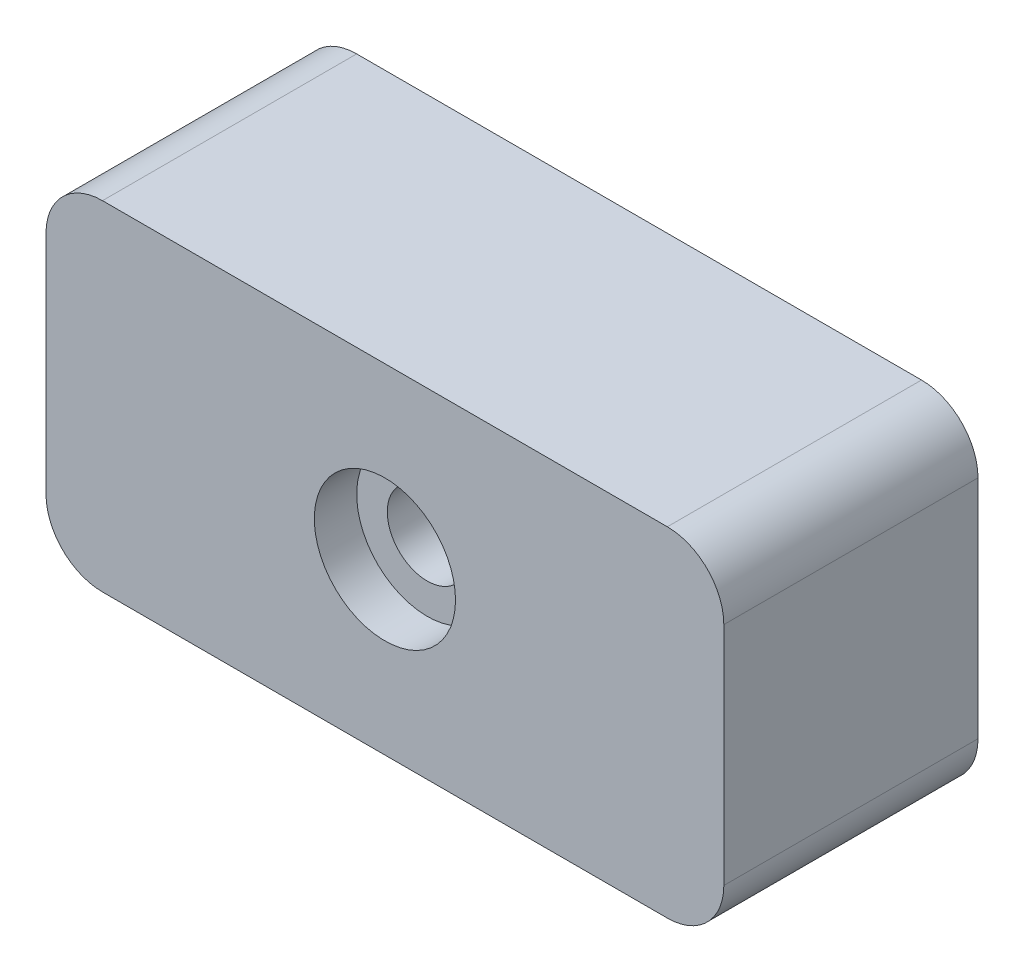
ISO-10303-21;
HEADER;
FILE_DESCRIPTION(('STEP AP214'),'2;1');
FILE_NAME('part.step','',(''),(''),'','','');
FILE_SCHEMA(('AUTOMOTIVE_DESIGN { 1 0 10303 214 1 1 1 1 }'));
ENDSEC;
DATA;
#1=APPLICATION_CONTEXT('core data for automotive mechanical design processes');
#2=APPLICATION_PROTOCOL_DEFINITION('international standard','automotive_design',2000,#1);
#3=PRODUCT_CONTEXT('',#1,'mechanical');
#4=PRODUCT('Part','Part','',(#3));
#5=PRODUCT_RELATED_PRODUCT_CATEGORY('part','',(#4));
#6=PRODUCT_DEFINITION_FORMATION('','',#4);
#7=PRODUCT_DEFINITION_CONTEXT('part definition',#1,'design');
#8=PRODUCT_DEFINITION('design','',#6,#7);
#9=PRODUCT_DEFINITION_SHAPE('','',#8);
#10=(LENGTH_UNIT() NAMED_UNIT(*) SI_UNIT(.MILLI.,.METRE.));
#11=(NAMED_UNIT(*) PLANE_ANGLE_UNIT() SI_UNIT($,.RADIAN.));
#12=(NAMED_UNIT(*) SI_UNIT($,.STERADIAN.) SOLID_ANGLE_UNIT());
#13=UNCERTAINTY_MEASURE_WITH_UNIT(LENGTH_MEASURE(1.E-05),#10,'distance_accuracy_value','');
#14=(GEOMETRIC_REPRESENTATION_CONTEXT(3) GLOBAL_UNCERTAINTY_ASSIGNED_CONTEXT((#13)) GLOBAL_UNIT_ASSIGNED_CONTEXT((#10,
#11,#12)) REPRESENTATION_CONTEXT('',''));
#15=CARTESIAN_POINT('',(0.,0.,0.));
#16=DIRECTION('',(0.,0.,1.));
#17=DIRECTION('',(1.,0.,0.));
#18=AXIS2_PLACEMENT_3D('',#15,#16,#17);
#19=CARTESIAN_POINT('',(19.05,-9.52500000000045,14.2875000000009));
#20=DIRECTION('',(-1.,0.,0.));
#21=DIRECTION('',(0.,0.,0.999999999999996));
#22=AXIS2_PLACEMENT_3D('',#19,#20,#21);
#23=PLANE('',#22);
#24=DIRECTION('',(0.,1.,0.));
#25=VECTOR('',#24,1.);
#26=CARTESIAN_POINT('',(19.05,-9.52500000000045,14.2875000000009));
#27=LINE('',#26,#25);
#28=CARTESIAN_POINT('',(19.0499999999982,-6.35000000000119,14.2875000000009));
#29=VERTEX_POINT('',#28);
#30=CARTESIAN_POINT('',(19.0499999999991,6.34999999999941,14.2875));
#31=VERTEX_POINT('',#30);
#32=EDGE_CURVE('E124',#29,#31,#27,.T.);
#33=ORIENTED_EDGE('',*,*,#32,.F.);
#34=DIRECTION('',(0.,0.,-0.999999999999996));
#35=VECTOR('',#34,1.);
#36=CARTESIAN_POINT('',(19.0499999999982,-6.35000000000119,14.2875000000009));
#37=LINE('',#36,#35);
#38=CARTESIAN_POINT('',(19.0499999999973,-6.3500000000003,-8.88178419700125E-13));
#39=VERTEX_POINT('',#38);
#40=EDGE_CURVE('E109',#29,#39,#37,.T.);
#41=ORIENTED_EDGE('',*,*,#40,.T.);
#42=DIRECTION('',(0.,1.,0.));
#43=VECTOR('',#42,1.);
#44=CARTESIAN_POINT('',(19.0499999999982,-9.52500000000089,0.));
#45=LINE('',#44,#43);
#46=CARTESIAN_POINT('',(19.05,6.34999999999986,0.));
#47=VERTEX_POINT('',#46);
#48=EDGE_CURVE('E121',#39,#47,#45,.T.);
#49=ORIENTED_EDGE('',*,*,#48,.T.);
#50=DIRECTION('',(0.,0.,-0.999999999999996));
#51=VECTOR('',#50,1.);
#52=CARTESIAN_POINT('',(19.0499999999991,6.34999999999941,14.2875));
#53=LINE('',#52,#51);
#54=EDGE_CURVE('E126',#47,#31,#53,.F.);
#55=ORIENTED_EDGE('',*,*,#54,.T.);
#56=EDGE_LOOP('',(#33,#41,#49,#55));
#57=FACE_BOUND('',#56,.T.);
#58=ADVANCED_FACE('F38',(#57),#23,.F.);
#59=CARTESIAN_POINT('',(-19.0500000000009,9.52499999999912,14.2875));
#60=DIRECTION('',(0.,-1.,0.));
#61=DIRECTION('',(0.,0.,-0.999999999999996));
#62=AXIS2_PLACEMENT_3D('',#59,#60,#61);
#63=PLANE('',#62);
#64=DIRECTION('',(-1.,0.,0.));
#65=VECTOR('',#64,1.);
#66=CARTESIAN_POINT('',(-19.0500000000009,9.52499999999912,14.2875));
#67=LINE('',#66,#65);
#68=CARTESIAN_POINT('',(15.8750000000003,9.52500000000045,14.2875000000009));
#69=VERTEX_POINT('',#68);
#70=CARTESIAN_POINT('',(-15.8750000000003,9.52500000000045,14.2874999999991));
#71=VERTEX_POINT('',#70);
#72=EDGE_CURVE('E168',#69,#71,#67,.T.);
#73=ORIENTED_EDGE('',*,*,#72,.F.);
#74=DIRECTION('',(0.,0.,-0.999999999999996));
#75=VECTOR('',#74,1.);
#76=CARTESIAN_POINT('',(15.8750000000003,9.52500000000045,14.2875000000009));
#77=LINE('',#76,#75);
#78=CARTESIAN_POINT('',(15.8750000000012,9.52500000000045,8.88178419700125E-13));
#79=VERTEX_POINT('',#78);
#80=EDGE_CURVE('E11',#69,#79,#77,.T.);
#81=ORIENTED_EDGE('',*,*,#80,.T.);
#82=DIRECTION('',(-1.,0.,0.));
#83=VECTOR('',#82,1.);
#84=CARTESIAN_POINT('',(-19.05,9.52499999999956,-8.88178419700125E-13));
#85=LINE('',#84,#83);
#86=CARTESIAN_POINT('',(-15.8750000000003,9.52500000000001,0.));
#87=VERTEX_POINT('',#86);
#88=EDGE_CURVE('E131',#79,#87,#85,.T.);
#89=ORIENTED_EDGE('',*,*,#88,.T.);
#90=DIRECTION('',(0.,0.,-0.999999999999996));
#91=VECTOR('',#90,1.);
#92=CARTESIAN_POINT('',(-15.8750000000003,9.52500000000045,14.2874999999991));
#93=LINE('',#92,#91);
#94=EDGE_CURVE('E46',#87,#71,#93,.F.);
#95=ORIENTED_EDGE('',*,*,#94,.T.);
#96=EDGE_LOOP('',(#73,#81,#89,#95));
#97=FACE_BOUND('',#96,.T.);
#98=ADVANCED_FACE('F167',(#97),#63,.F.);
#99=CARTESIAN_POINT('',(-19.0500000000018,-9.52500000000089,14.2874999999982));
#100=DIRECTION('',(1.,0.,0.));
#101=DIRECTION('',(0.,0.,-0.999999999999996));
#102=AXIS2_PLACEMENT_3D('',#99,#100,#101);
#103=PLANE('',#102);
#104=DIRECTION('',(0.,-1.,0.));
#105=VECTOR('',#104,1.);
#106=CARTESIAN_POINT('',(-19.0500000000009,-9.52500000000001,0.));
#107=LINE('',#106,#105);
#108=CARTESIAN_POINT('',(-19.05,6.34999999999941,0.));
#109=VERTEX_POINT('',#108);
#110=CARTESIAN_POINT('',(-19.0500000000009,-6.35000000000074,8.88178419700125E-13));
#111=VERTEX_POINT('',#110);
#112=EDGE_CURVE('E135',#109,#111,#107,.T.);
#113=ORIENTED_EDGE('',*,*,#112,.T.);
#114=DIRECTION('',(0.,0.,-0.999999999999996));
#115=VECTOR('',#114,1.);
#116=CARTESIAN_POINT('',(-19.05,-6.34999999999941,14.2875));
#117=LINE('',#116,#115);
#118=CARTESIAN_POINT('',(-19.05,-6.34999999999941,14.2875));
#119=VERTEX_POINT('',#118);
#120=EDGE_CURVE('E53',#111,#119,#117,.F.);
#121=ORIENTED_EDGE('',*,*,#120,.T.);
#122=DIRECTION('',(0.,-1.,0.));
#123=VECTOR('',#122,1.);
#124=CARTESIAN_POINT('',(-19.0500000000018,-9.52500000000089,14.2874999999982));
#125=LINE('',#124,#123);
#126=CARTESIAN_POINT('',(-19.0500000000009,6.34999999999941,14.2875));
#127=VERTEX_POINT('',#126);
#128=EDGE_CURVE('E174',#127,#119,#125,.T.);
#129=ORIENTED_EDGE('',*,*,#128,.F.);
#130=DIRECTION('',(0.,0.,-0.999999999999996));
#131=VECTOR('',#130,1.);
#132=CARTESIAN_POINT('',(-19.0500000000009,6.34999999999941,14.2875));
#133=LINE('',#132,#131);
#134=EDGE_CURVE('E161',#127,#109,#133,.T.);
#135=ORIENTED_EDGE('',*,*,#134,.T.);
#136=EDGE_LOOP('',(#113,#121,#129,#135));
#137=FACE_BOUND('',#136,.T.);
#138=ADVANCED_FACE('F178',(#137),#103,.F.);
#139=CARTESIAN_POINT('',(-19.0500000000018,-9.52500000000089,14.2874999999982));
#140=DIRECTION('',(0.,1.,0.));
#141=DIRECTION('',(0.,0.,0.999999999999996));
#142=AXIS2_PLACEMENT_3D('',#139,#140,#141);
#143=PLANE('',#142);
#144=DIRECTION('',(1.,0.,0.));
#145=VECTOR('',#144,1.);
#146=CARTESIAN_POINT('',(-19.0500000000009,-9.52500000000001,0.));
#147=LINE('',#146,#145);
#148=CARTESIAN_POINT('',(-15.8749999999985,-9.52500000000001,0.));
#149=VERTEX_POINT('',#148);
#150=CARTESIAN_POINT('',(15.8749999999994,-9.52500000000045,8.88178419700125E-13));
#151=VERTEX_POINT('',#150);
#152=EDGE_CURVE('E145',#149,#151,#147,.T.);
#153=ORIENTED_EDGE('',*,*,#152,.T.);
#154=DIRECTION('',(0.,0.,-0.999999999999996));
#155=VECTOR('',#154,1.);
#156=CARTESIAN_POINT('',(15.8749999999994,-9.52500000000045,14.2875));
#157=LINE('',#156,#155);
#158=CARTESIAN_POINT('',(15.8749999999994,-9.52500000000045,14.2875));
#159=VERTEX_POINT('',#158);
#160=EDGE_CURVE('E110',#151,#159,#157,.F.);
#161=ORIENTED_EDGE('',*,*,#160,.T.);
#162=DIRECTION('',(1.,0.,0.));
#163=VECTOR('',#162,1.);
#164=CARTESIAN_POINT('',(-19.0500000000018,-9.52500000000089,14.2874999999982));
#165=LINE('',#164,#163);
#166=CARTESIAN_POINT('',(-15.8750000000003,-9.52500000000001,14.2875));
#167=VERTEX_POINT('',#166);
#168=EDGE_CURVE('E141',#167,#159,#165,.T.);
#169=ORIENTED_EDGE('',*,*,#168,.F.);
#170=DIRECTION('',(0.,0.,-0.999999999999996));
#171=VECTOR('',#170,1.);
#172=CARTESIAN_POINT('',(-15.8750000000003,-9.52500000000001,14.2875));
#173=LINE('',#172,#171);
#174=EDGE_CURVE('E115',#167,#149,#173,.T.);
#175=ORIENTED_EDGE('',*,*,#174,.T.);
#176=EDGE_LOOP('',(#153,#161,#169,#175));
#177=FACE_BOUND('',#176,.T.);
#178=ADVANCED_FACE('F185',(#177),#143,.F.);
#179=CARTESIAN_POINT('',(19.05,9.52499999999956,14.2875000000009));
#180=DIRECTION('',(0.,0.,-0.999999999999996));
#181=DIRECTION('',(-1.,0.,0.));
#182=AXIS2_PLACEMENT_3D('',#179,#180,#181);
#183=PLANE('',#182);
#184=CARTESIAN_POINT('',(8.88178419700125E-13,-4.44089209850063E-13,14.2875));
#185=DIRECTION('',(0.,0.,0.999999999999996));
#186=DIRECTION('',(1.,0.,0.));
#187=AXIS2_PLACEMENT_3D('',#184,#185,#186);
#188=CIRCLE('',#187,3.96875);
#189=CARTESIAN_POINT('',(3.96875000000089,-4.44199364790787E-13,14.2875));
#190=VERTEX_POINT('',#189);
#191=EDGE_CURVE('E193',#190,#190,#188,.T.);
#192=ORIENTED_EDGE('',*,*,#191,.F.);
#193=EDGE_LOOP('',(#192));
#194=FACE_BOUND('',#193,.T.);
#195=ORIENTED_EDGE('',*,*,#168,.T.);
#196=CARTESIAN_POINT('',(15.8750000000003,-6.35000000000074,14.2874999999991));
#197=DIRECTION('',(0.,0.,-0.999999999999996));
#198=DIRECTION('',(-1.,0.,0.));
#199=AXIS2_PLACEMENT_3D('',#196,#197,#198);
#200=CIRCLE('',#199,3.175);
#201=EDGE_CURVE('E159',#159,#29,#200,.F.);
#202=ORIENTED_EDGE('',*,*,#201,.T.);
#203=ORIENTED_EDGE('',*,*,#32,.T.);
#204=CARTESIAN_POINT('',(15.8750000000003,6.34999999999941,14.2875000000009));
#205=DIRECTION('',(0.,0.,-0.999999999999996));
#206=DIRECTION('',(-1.,0.,0.));
#207=AXIS2_PLACEMENT_3D('',#204,#205,#206);
#208=CIRCLE('',#207,3.175);
#209=EDGE_CURVE('E155',#31,#69,#208,.F.);
#210=ORIENTED_EDGE('',*,*,#209,.T.);
#211=ORIENTED_EDGE('',*,*,#72,.T.);
#212=CARTESIAN_POINT('',(-15.8750000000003,6.34999999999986,14.2875000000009));
#213=DIRECTION('',(0.,0.,-0.999999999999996));
#214=DIRECTION('',(-1.,0.,0.));
#215=AXIS2_PLACEMENT_3D('',#212,#213,#214);
#216=CIRCLE('',#215,3.175);
#217=EDGE_CURVE('E60',#71,#127,#216,.F.);
#218=ORIENTED_EDGE('',*,*,#217,.T.);
#219=ORIENTED_EDGE('',*,*,#128,.T.);
#220=CARTESIAN_POINT('',(-15.8749999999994,-6.34999999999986,14.2874999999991));
#221=DIRECTION('',(0.,0.,-0.999999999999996));
#222=DIRECTION('',(-1.,0.,0.));
#223=AXIS2_PLACEMENT_3D('',#220,#221,#222);
#224=CIRCLE('',#223,3.175);
#225=EDGE_CURVE('E157',#119,#167,#224,.F.);
#226=ORIENTED_EDGE('',*,*,#225,.T.);
#227=EDGE_LOOP('',(#195,#202,#203,#210,#211,#218,#219,#226));
#228=FACE_BOUND('',#227,.T.);
#229=ADVANCED_FACE('F172',(#194,#228),#183,.F.);
#230=CARTESIAN_POINT('',(19.0499999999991,9.52500000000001,8.88178419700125E-13));
#231=DIRECTION('',(0.,0.,-0.999999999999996));
#232=DIRECTION('',(-1.,0.,0.));
#233=AXIS2_PLACEMENT_3D('',#230,#231,#232);
#234=PLANE('',#233);
#235=CARTESIAN_POINT('',(0.,0.,0.));
#236=DIRECTION('',(0.,0.,0.999999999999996));
#237=DIRECTION('',(1.,0.,0.));
#238=AXIS2_PLACEMENT_3D('',#235,#236,#237);
#239=CIRCLE('',#238,2.2479);
#240=CARTESIAN_POINT('',(2.24790000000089,-4.44151601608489E-13,0.));
#241=VERTEX_POINT('',#240);
#242=EDGE_CURVE('E132',#241,#241,#239,.T.);
#243=ORIENTED_EDGE('',*,*,#242,.T.);
#244=EDGE_LOOP('',(#243));
#245=FACE_BOUND('',#244,.T.);
#246=ORIENTED_EDGE('',*,*,#48,.F.);
#247=CARTESIAN_POINT('',(15.8750000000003,-6.3500000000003,0.));
#248=DIRECTION('',(0.,0.,-0.999999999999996));
#249=DIRECTION('',(-1.,0.,0.));
#250=AXIS2_PLACEMENT_3D('',#247,#248,#249);
#251=CIRCLE('',#250,3.175);
#252=EDGE_CURVE('E105',#39,#151,#251,.T.);
#253=ORIENTED_EDGE('',*,*,#252,.T.);
#254=ORIENTED_EDGE('',*,*,#152,.F.);
#255=CARTESIAN_POINT('',(-15.8750000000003,-6.3500000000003,1.77635683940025E-12));
#256=DIRECTION('',(0.,0.,-0.999999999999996));
#257=DIRECTION('',(-1.,0.,0.));
#258=AXIS2_PLACEMENT_3D('',#255,#256,#257);
#259=CIRCLE('',#258,3.175);
#260=EDGE_CURVE('E116',#149,#111,#259,.T.);
#261=ORIENTED_EDGE('',*,*,#260,.T.);
#262=ORIENTED_EDGE('',*,*,#112,.F.);
#263=CARTESIAN_POINT('',(-15.8749999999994,6.34999999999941,-8.88178419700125E-13));
#264=DIRECTION('',(0.,0.,-0.999999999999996));
#265=DIRECTION('',(-1.,0.,0.));
#266=AXIS2_PLACEMENT_3D('',#263,#264,#265);
#267=CIRCLE('',#266,3.175);
#268=EDGE_CURVE('E125',#109,#87,#267,.T.);
#269=ORIENTED_EDGE('',*,*,#268,.T.);
#270=ORIENTED_EDGE('',*,*,#88,.F.);
#271=CARTESIAN_POINT('',(15.8749999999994,6.34999999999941,0.));
#272=DIRECTION('',(0.,0.,-0.999999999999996));
#273=DIRECTION('',(-1.,0.,0.));
#274=AXIS2_PLACEMENT_3D('',#271,#272,#273);
#275=CIRCLE('',#274,3.175);
#276=EDGE_CURVE('E130',#79,#47,#275,.T.);
#277=ORIENTED_EDGE('',*,*,#276,.T.);
#278=EDGE_LOOP('',(#246,#253,#254,#261,#262,#269,#270,#277));
#279=FACE_BOUND('',#278,.T.);
#280=ADVANCED_FACE('F128',(#245,#279),#234,.T.);
#281=CARTESIAN_POINT('',(8.88178419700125E-13,-4.44089209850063E-13,14.2875));
#282=DIRECTION('',(0.,0.,0.999999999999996));
#283=DIRECTION('',(1.,0.,0.));
#284=AXIS2_PLACEMENT_3D('',#281,#282,#283);
#285=CYLINDRICAL_SURFACE('',#284,2.2479);
#286=CARTESIAN_POINT('',(-8.88178419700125E-13,-4.44089209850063E-13,11.9062499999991));
#287=DIRECTION('',(0.,0.,0.999999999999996));
#288=DIRECTION('',(1.,0.,0.));
#289=AXIS2_PLACEMENT_3D('',#286,#287,#288);
#290=CIRCLE('',#289,2.2479);
#291=CARTESIAN_POINT('',(2.24790000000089,-4.44151601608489E-13,11.9062499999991));
#292=VERTEX_POINT('',#291);
#293=EDGE_CURVE('E138',#292,#292,#290,.T.);
#294=CARTESIAN_POINT('',(2.24790000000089,-4.44151601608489E-13,0.));
#295=CARTESIAN_POINT('',(2.24790000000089,-4.44151601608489E-13,0.124023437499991));
#296=CARTESIAN_POINT('',(2.24790000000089,-4.44151601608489E-13,0.248046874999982));
#297=CARTESIAN_POINT('',(2.24790000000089,-4.44151601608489E-13,0.496093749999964));
#298=CARTESIAN_POINT('',(2.24790000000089,-4.44151601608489E-13,0.620117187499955));
#299=CARTESIAN_POINT('',(2.24790000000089,-4.44151601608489E-13,0.868164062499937));
#300=CARTESIAN_POINT('',(2.24790000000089,-4.44151601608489E-13,0.992187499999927));
#301=CARTESIAN_POINT('',(2.24790000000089,-4.44151601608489E-13,1.24023437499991));
#302=CARTESIAN_POINT('',(2.24790000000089,-4.44151601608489E-13,1.3642578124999));
#303=CARTESIAN_POINT('',(2.24790000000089,-4.44151601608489E-13,1.61230468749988));
#304=CARTESIAN_POINT('',(2.24790000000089,-4.44151601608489E-13,1.73632812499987));
#305=CARTESIAN_POINT('',(2.24790000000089,-4.44151601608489E-13,1.98437499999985));
#306=CARTESIAN_POINT('',(2.24790000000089,-4.44151601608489E-13,2.10839843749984));
#307=CARTESIAN_POINT('',(2.24790000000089,-4.44151601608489E-13,2.35644531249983));
#308=CARTESIAN_POINT('',(2.24790000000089,-4.44151601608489E-13,2.48046874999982));
#309=CARTESIAN_POINT('',(2.24790000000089,-4.44151601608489E-13,2.7285156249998));
#310=CARTESIAN_POINT('',(2.24790000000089,-4.44151601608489E-13,2.85253906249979));
#311=CARTESIAN_POINT('',(2.24790000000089,-4.44151601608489E-13,3.10058593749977));
#312=CARTESIAN_POINT('',(2.24790000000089,-4.44151601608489E-13,3.22460937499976));
#313=CARTESIAN_POINT('',(2.24790000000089,-4.44151601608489E-13,3.47265624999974));
#314=CARTESIAN_POINT('',(2.24790000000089,-4.44151601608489E-13,3.59667968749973));
#315=CARTESIAN_POINT('',(2.24790000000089,-4.44151601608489E-13,3.84472656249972));
#316=CARTESIAN_POINT('',(2.24790000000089,-4.44151601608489E-13,3.96874999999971));
#317=CARTESIAN_POINT('',(2.24790000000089,-4.44151601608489E-13,4.21679687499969));
#318=CARTESIAN_POINT('',(2.24790000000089,-4.44151601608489E-13,4.34082031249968));
#319=CARTESIAN_POINT('',(2.24790000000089,-4.44151601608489E-13,4.58886718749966));
#320=CARTESIAN_POINT('',(2.24790000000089,-4.44151601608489E-13,4.71289062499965));
#321=CARTESIAN_POINT('',(2.24790000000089,-4.44151601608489E-13,4.96093749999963));
#322=CARTESIAN_POINT('',(2.24790000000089,-4.44151601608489E-13,5.08496093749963));
#323=CARTESIAN_POINT('',(2.24790000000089,-4.44151601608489E-13,5.33300781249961));
#324=CARTESIAN_POINT('',(2.24790000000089,-4.44151601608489E-13,5.4570312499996));
#325=CARTESIAN_POINT('',(2.24790000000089,-4.44151601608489E-13,5.70507812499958));
#326=CARTESIAN_POINT('',(2.24790000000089,-4.44151601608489E-13,5.82910156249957));
#327=CARTESIAN_POINT('',(2.24790000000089,-4.44151601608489E-13,6.07714843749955));
#328=CARTESIAN_POINT('',(2.24790000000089,-4.44151601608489E-13,6.20117187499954));
#329=CARTESIAN_POINT('',(2.24790000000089,-4.44151601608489E-13,6.44921874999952));
#330=CARTESIAN_POINT('',(2.24790000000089,-4.44151601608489E-13,6.57324218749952));
#331=CARTESIAN_POINT('',(2.24790000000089,-4.44151601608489E-13,6.8212890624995));
#332=CARTESIAN_POINT('',(2.24790000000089,-4.44151601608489E-13,6.94531249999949));
#333=CARTESIAN_POINT('',(2.24790000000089,-4.44151601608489E-13,7.19335937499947));
#334=CARTESIAN_POINT('',(2.24790000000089,-4.44151601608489E-13,7.31738281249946));
#335=CARTESIAN_POINT('',(2.24790000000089,-4.44151601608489E-13,7.56542968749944));
#336=CARTESIAN_POINT('',(2.24790000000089,-4.44151601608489E-13,7.68945312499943));
#337=CARTESIAN_POINT('',(2.24790000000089,-4.44151601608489E-13,7.93749999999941));
#338=CARTESIAN_POINT('',(2.24790000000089,-4.44151601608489E-13,8.0615234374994));
#339=CARTESIAN_POINT('',(2.24790000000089,-4.44151601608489E-13,8.30957031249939));
#340=CARTESIAN_POINT('',(2.24790000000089,-4.44151601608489E-13,8.43359374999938));
#341=CARTESIAN_POINT('',(2.24790000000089,-4.44151601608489E-13,8.68164062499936));
#342=CARTESIAN_POINT('',(2.24790000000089,-4.44151601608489E-13,8.80566406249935));
#343=CARTESIAN_POINT('',(2.24790000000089,-4.44151601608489E-13,9.05371093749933));
#344=CARTESIAN_POINT('',(2.24790000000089,-4.44151601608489E-13,9.17773437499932));
#345=CARTESIAN_POINT('',(2.24790000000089,-4.44151601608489E-13,9.4257812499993));
#346=CARTESIAN_POINT('',(2.24790000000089,-4.44151601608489E-13,9.54980468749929));
#347=CARTESIAN_POINT('',(2.24790000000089,-4.44151601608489E-13,9.79785156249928));
#348=CARTESIAN_POINT('',(2.24790000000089,-4.44151601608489E-13,9.92187499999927));
#349=CARTESIAN_POINT('',(2.24790000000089,-4.44151601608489E-13,10.1699218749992));
#350=CARTESIAN_POINT('',(2.24790000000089,-4.44151601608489E-13,10.2939453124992));
#351=CARTESIAN_POINT('',(2.24790000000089,-4.44151601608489E-13,10.5419921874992));
#352=CARTESIAN_POINT('',(2.24790000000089,-4.44151601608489E-13,10.6660156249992));
#353=CARTESIAN_POINT('',(2.24790000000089,-4.44151601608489E-13,10.9140624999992));
#354=CARTESIAN_POINT('',(2.24790000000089,-4.44151601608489E-13,11.0380859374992));
#355=CARTESIAN_POINT('',(2.24790000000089,-4.44151601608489E-13,11.2861328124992));
#356=CARTESIAN_POINT('',(2.24790000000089,-4.44151601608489E-13,11.4101562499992));
#357=CARTESIAN_POINT('',(2.24790000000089,-4.44151601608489E-13,11.6582031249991));
#358=CARTESIAN_POINT('',(2.24790000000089,-4.44151601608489E-13,11.7822265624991));
#359=CARTESIAN_POINT('',(2.24790000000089,-4.44151601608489E-13,11.9062499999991));
#360=B_SPLINE_CURVE_WITH_KNOTS('',3,(#294,#295,#296,#297,#298,#299,#300,#301,#302,#303,#304,
#305,#306,#307,#308,#309,#310,#311,#312,#313,#314,#315,#316,#317,#318,#319,#320,#321,#322,#323,
#324,#325,#326,#327,#328,#329,#330,#331,#332,#333,#334,#335,#336,#337,#338,#339,#340,#341,#342,
#343,#344,#345,#346,#347,#348,#349,#350,#351,#352,#353,#354,#355,#356,#357,#358,#359),
.UNSPECIFIED.,.F.,.F.,(4,2,2,2,2,2,2,2,2,2,2,2,2,2,2,2,2,2,2,2,2,2,2,2,2,2,2,2,2,2,2,2,4),(0.,
0.372070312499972,0.744140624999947,1.11621093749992,1.48828124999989,1.86035156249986,
2.23242187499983,2.60449218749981,2.97656249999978,3.34863281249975,3.72070312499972,
4.0927734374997,4.46484374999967,4.83691406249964,5.20898437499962,5.58105468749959,
5.95312499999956,6.32519531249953,6.69726562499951,7.06933593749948,7.44140624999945,
7.81347656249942,8.1855468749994,8.55761718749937,8.92968749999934,9.30175781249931,
9.67382812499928,10.0458984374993,10.4179687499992,10.7900390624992,11.1621093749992,
11.5341796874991,11.9062499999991),.UNSPECIFIED.);
#361=EDGE_CURVE('BSEAM205',#241,#292,#360,.T.);
#362=ORIENTED_EDGE('',*,*,#242,.F.);
#363=ORIENTED_EDGE('',*,*,#293,.T.);
#364=ORIENTED_EDGE('',*,*,#361,.T.);
#365=ORIENTED_EDGE('',*,*,#361,.F.);
#366=EDGE_LOOP('',(#362,#364,#363,#365));
#367=FACE_BOUND('',#366,.T.);
#368=ADVANCED_FACE('F205',(#367),#285,.F.);
#369=CARTESIAN_POINT('',(2.24790000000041,-4.44089209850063E-13,11.90625));
#370=DIRECTION('',(0.,0.,-0.999999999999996));
#371=DIRECTION('',(-1.,0.,0.));
#372=AXIS2_PLACEMENT_3D('',#369,#370,#371);
#373=PLANE('',#372);
#374=ORIENTED_EDGE('',*,*,#293,.F.);
#375=EDGE_LOOP('',(#374));
#376=FACE_BOUND('',#375,.T.);
#377=CARTESIAN_POINT('',(-8.88178419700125E-13,-4.44089209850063E-13,11.9062499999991));
#378=DIRECTION('',(0.,0.,0.999999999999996));
#379=DIRECTION('',(1.,0.,0.));
#380=AXIS2_PLACEMENT_3D('',#377,#378,#379);
#381=CIRCLE('',#380,3.96875);
#382=CARTESIAN_POINT('',(3.96875000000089,-4.44199364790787E-13,11.9062499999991));
#383=VERTEX_POINT('',#382);
#384=EDGE_CURVE('E190',#383,#383,#381,.T.);
#385=ORIENTED_EDGE('',*,*,#384,.T.);
#386=EDGE_LOOP('',(#385));
#387=FACE_BOUND('',#386,.T.);
#388=ADVANCED_FACE('F254',(#376,#387),#373,.F.);
#389=CARTESIAN_POINT('',(8.88178419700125E-13,-4.44089209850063E-13,14.2875));
#390=DIRECTION('',(0.,0.,0.999999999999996));
#391=DIRECTION('',(1.,0.,0.));
#392=AXIS2_PLACEMENT_3D('',#389,#390,#391);
#393=CYLINDRICAL_SURFACE('',#392,3.96875);
#394=CARTESIAN_POINT('',(3.96875000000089,-4.44199364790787E-13,11.9062499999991));
#395=CARTESIAN_POINT('',(3.96875000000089,-4.44199364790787E-13,11.9310546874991));
#396=CARTESIAN_POINT('',(3.96875000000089,-4.44199364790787E-13,11.9558593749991));
#397=CARTESIAN_POINT('',(3.96875000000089,-4.44199364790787E-13,12.0054687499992));
#398=CARTESIAN_POINT('',(3.96875000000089,-4.44199364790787E-13,12.0302734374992));
#399=CARTESIAN_POINT('',(3.96875000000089,-4.44199364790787E-13,12.0798828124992));
#400=CARTESIAN_POINT('',(3.96875000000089,-4.44199364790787E-13,12.1046874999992));
#401=CARTESIAN_POINT('',(3.96875000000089,-4.44199364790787E-13,12.1542968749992));
#402=CARTESIAN_POINT('',(3.96875000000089,-4.44199364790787E-13,12.1791015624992));
#403=CARTESIAN_POINT('',(3.96875000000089,-4.44199364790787E-13,12.2287109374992));
#404=CARTESIAN_POINT('',(3.96875000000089,-4.44199364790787E-13,12.2535156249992));
#405=CARTESIAN_POINT('',(3.96875000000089,-4.44199364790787E-13,12.3031249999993));
#406=CARTESIAN_POINT('',(3.96875000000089,-4.44199364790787E-13,12.3279296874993));
#407=CARTESIAN_POINT('',(3.96875000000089,-4.44199364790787E-13,12.3775390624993));
#408=CARTESIAN_POINT('',(3.96875000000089,-4.44199364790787E-13,12.4023437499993));
#409=CARTESIAN_POINT('',(3.96875000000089,-4.44199364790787E-13,12.4519531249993));
#410=CARTESIAN_POINT('',(3.96875000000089,-4.44199364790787E-13,12.4767578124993));
#411=CARTESIAN_POINT('',(3.96875000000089,-4.44199364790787E-13,12.5263671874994));
#412=CARTESIAN_POINT('',(3.96875000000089,-4.44199364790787E-13,12.5511718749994));
#413=CARTESIAN_POINT('',(3.96875000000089,-4.44199364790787E-13,12.6007812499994));
#414=CARTESIAN_POINT('',(3.96875000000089,-4.44199364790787E-13,12.6255859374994));
#415=CARTESIAN_POINT('',(3.96875000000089,-4.44199364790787E-13,12.6751953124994));
#416=CARTESIAN_POINT('',(3.96875000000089,-4.44199364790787E-13,12.6999999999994));
#417=CARTESIAN_POINT('',(3.96875000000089,-4.44199364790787E-13,12.7496093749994));
#418=CARTESIAN_POINT('',(3.96875000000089,-4.44199364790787E-13,12.7744140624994));
#419=CARTESIAN_POINT('',(3.96875000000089,-4.44199364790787E-13,12.8240234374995));
#420=CARTESIAN_POINT('',(3.96875000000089,-4.44199364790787E-13,12.8488281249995));
#421=CARTESIAN_POINT('',(3.96875000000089,-4.44199364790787E-13,12.8984374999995));
#422=CARTESIAN_POINT('',(3.96875000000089,-4.44199364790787E-13,12.9232421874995));
#423=CARTESIAN_POINT('',(3.96875000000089,-4.44199364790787E-13,12.9728515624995));
#424=CARTESIAN_POINT('',(3.96875000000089,-4.44199364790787E-13,12.9976562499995));
#425=CARTESIAN_POINT('',(3.96875000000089,-4.44199364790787E-13,13.0472656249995));
#426=CARTESIAN_POINT('',(3.96875000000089,-4.44199364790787E-13,13.0720703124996));
#427=CARTESIAN_POINT('',(3.96875000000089,-4.44199364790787E-13,13.1216796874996));
#428=CARTESIAN_POINT('',(3.96875000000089,-4.44199364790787E-13,13.1464843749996));
#429=CARTESIAN_POINT('',(3.96875000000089,-4.44199364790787E-13,13.1960937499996));
#430=CARTESIAN_POINT('',(3.96875000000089,-4.44199364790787E-13,13.2208984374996));
#431=CARTESIAN_POINT('',(3.96875000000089,-4.44199364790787E-13,13.2705078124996));
#432=CARTESIAN_POINT('',(3.96875000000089,-4.44199364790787E-13,13.2953124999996));
#433=CARTESIAN_POINT('',(3.96875000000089,-4.44199364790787E-13,13.3449218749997));
#434=CARTESIAN_POINT('',(3.96875000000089,-4.44199364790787E-13,13.3697265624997));
#435=CARTESIAN_POINT('',(3.96875000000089,-4.44199364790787E-13,13.4193359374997));
#436=CARTESIAN_POINT('',(3.96875000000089,-4.44199364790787E-13,13.4441406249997));
#437=CARTESIAN_POINT('',(3.96875000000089,-4.44199364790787E-13,13.4937499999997));
#438=CARTESIAN_POINT('',(3.96875000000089,-4.44199364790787E-13,13.5185546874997));
#439=CARTESIAN_POINT('',(3.96875000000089,-4.44199364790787E-13,13.5681640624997));
#440=CARTESIAN_POINT('',(3.96875000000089,-4.44199364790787E-13,13.5929687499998));
#441=CARTESIAN_POINT('',(3.96875000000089,-4.44199364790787E-13,13.6425781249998));
#442=CARTESIAN_POINT('',(3.96875000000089,-4.44199364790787E-13,13.6673828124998));
#443=CARTESIAN_POINT('',(3.96875000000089,-4.44199364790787E-13,13.7169921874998));
#444=CARTESIAN_POINT('',(3.96875000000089,-4.44199364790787E-13,13.7417968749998));
#445=CARTESIAN_POINT('',(3.96875000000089,-4.44199364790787E-13,13.7914062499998));
#446=CARTESIAN_POINT('',(3.96875000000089,-4.44199364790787E-13,13.8162109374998));
#447=CARTESIAN_POINT('',(3.96875000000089,-4.44199364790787E-13,13.8658203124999));
#448=CARTESIAN_POINT('',(3.96875000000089,-4.44199364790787E-13,13.8906249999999));
#449=CARTESIAN_POINT('',(3.96875000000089,-4.44199364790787E-13,13.9402343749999));
#450=CARTESIAN_POINT('',(3.96875000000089,-4.44199364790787E-13,13.9650390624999));
#451=CARTESIAN_POINT('',(3.96875000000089,-4.44199364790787E-13,14.0146484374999));
#452=CARTESIAN_POINT('',(3.96875000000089,-4.44199364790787E-13,14.0394531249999));
#453=CARTESIAN_POINT('',(3.96875000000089,-4.44199364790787E-13,14.0890624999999));
#454=CARTESIAN_POINT('',(3.96875000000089,-4.44199364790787E-13,14.1138671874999));
#455=CARTESIAN_POINT('',(3.96875000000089,-4.44199364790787E-13,14.1634765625));
#456=CARTESIAN_POINT('',(3.96875000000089,-4.44199364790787E-13,14.18828125));
#457=CARTESIAN_POINT('',(3.96875000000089,-4.44199364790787E-13,14.237890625));
#458=CARTESIAN_POINT('',(3.96875000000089,-4.44199364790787E-13,14.2626953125));
#459=CARTESIAN_POINT('',(3.96875000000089,-4.44199364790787E-13,14.2875));
#460=B_SPLINE_CURVE_WITH_KNOTS('',3,(#394,#395,#396,#397,#398,#399,#400,#401,#402,#403,#404,
#405,#406,#407,#408,#409,#410,#411,#412,#413,#414,#415,#416,#417,#418,#419,#420,#421,#422,#423,
#424,#425,#426,#427,#428,#429,#430,#431,#432,#433,#434,#435,#436,#437,#438,#439,#440,#441,#442,
#443,#444,#445,#446,#447,#448,#449,#450,#451,#452,#453,#454,#455,#456,#457,#458,#459),
.UNSPECIFIED.,.F.,.F.,(4,2,2,2,2,2,2,2,2,2,2,2,2,2,2,2,2,2,2,2,2,2,2,2,2,2,2,2,2,2,2,2,4),(0.,
0.0744140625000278,0.148828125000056,0.223242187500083,0.297656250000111,0.372070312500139,
0.446484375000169,0.520898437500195,0.595312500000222,0.66972656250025,0.744140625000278,
0.818554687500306,0.892968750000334,0.967382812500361,1.04179687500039,1.11621093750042,
1.19062500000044,1.26503906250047,1.3394531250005,1.41386718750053,1.48828125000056,
1.56269531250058,1.63710937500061,1.71152343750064,1.78593750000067,1.86035156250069,
1.93476562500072,2.00917968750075,2.08359375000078,2.15800781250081,2.23242187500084,
2.30683593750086,2.38125000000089),.UNSPECIFIED.);
#461=EDGE_CURVE('BSEAM197',#383,#190,#460,.T.);
#462=ORIENTED_EDGE('',*,*,#384,.F.);
#463=ORIENTED_EDGE('',*,*,#191,.T.);
#464=ORIENTED_EDGE('',*,*,#461,.T.);
#465=ORIENTED_EDGE('',*,*,#461,.F.);
#466=EDGE_LOOP('',(#462,#464,#463,#465));
#467=FACE_BOUND('',#466,.T.);
#468=ADVANCED_FACE('F197',(#467),#393,.F.);
#469=CARTESIAN_POINT('',(15.8750000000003,-6.35000000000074,14.2874999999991));
#470=DIRECTION('',(0.,0.,-0.999999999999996));
#471=DIRECTION('',(-1.,0.,0.));
#472=AXIS2_PLACEMENT_3D('',#469,#470,#471);
#473=CYLINDRICAL_SURFACE('',#472,3.175);
#474=ORIENTED_EDGE('',*,*,#201,.F.);
#475=ORIENTED_EDGE('',*,*,#160,.F.);
#476=ORIENTED_EDGE('',*,*,#252,.F.);
#477=ORIENTED_EDGE('',*,*,#40,.F.);
#478=EDGE_LOOP('',(#474,#475,#476,#477));
#479=FACE_BOUND('',#478,.T.);
#480=ADVANCED_FACE('F108',(#479),#473,.T.);
#481=CARTESIAN_POINT('',(-15.8749999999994,-6.34999999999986,14.2874999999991));
#482=DIRECTION('',(0.,0.,-0.999999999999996));
#483=DIRECTION('',(-1.,0.,0.));
#484=AXIS2_PLACEMENT_3D('',#481,#482,#483);
#485=CYLINDRICAL_SURFACE('',#484,3.175);
#486=ORIENTED_EDGE('',*,*,#225,.F.);
#487=ORIENTED_EDGE('',*,*,#120,.F.);
#488=ORIENTED_EDGE('',*,*,#260,.F.);
#489=ORIENTED_EDGE('',*,*,#174,.F.);
#490=EDGE_LOOP('',(#486,#487,#488,#489));
#491=FACE_BOUND('',#490,.T.);
#492=ADVANCED_FACE('F182',(#491),#485,.T.);
#493=CARTESIAN_POINT('',(15.8750000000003,6.34999999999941,14.2875000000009));
#494=DIRECTION('',(0.,0.,-0.999999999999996));
#495=DIRECTION('',(-1.,0.,0.));
#496=AXIS2_PLACEMENT_3D('',#493,#494,#495);
#497=CYLINDRICAL_SURFACE('',#496,3.175);
#498=ORIENTED_EDGE('',*,*,#209,.F.);
#499=ORIENTED_EDGE('',*,*,#54,.F.);
#500=ORIENTED_EDGE('',*,*,#276,.F.);
#501=ORIENTED_EDGE('',*,*,#80,.F.);
#502=EDGE_LOOP('',(#498,#499,#500,#501));
#503=FACE_BOUND('',#502,.T.);
#504=ADVANCED_FACE('F221',(#503),#497,.T.);
#505=CARTESIAN_POINT('',(-15.8750000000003,6.34999999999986,14.2875000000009));
#506=DIRECTION('',(0.,0.,-0.999999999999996));
#507=DIRECTION('',(-1.,0.,0.));
#508=AXIS2_PLACEMENT_3D('',#505,#506,#507);
#509=CYLINDRICAL_SURFACE('',#508,3.175);
#510=ORIENTED_EDGE('',*,*,#217,.F.);
#511=ORIENTED_EDGE('',*,*,#94,.F.);
#512=ORIENTED_EDGE('',*,*,#268,.F.);
#513=ORIENTED_EDGE('',*,*,#134,.F.);
#514=EDGE_LOOP('',(#510,#511,#512,#513));
#515=FACE_BOUND('',#514,.T.);
#516=ADVANCED_FACE('F40',(#515),#509,.T.);
#517=CLOSED_SHELL('',(#58,#98,#138,#178,#229,#280,#368,#388,#468,#480,#492,#504,#516));
#518=MANIFOLD_SOLID_BREP('B2',#517);
#519=ADVANCED_BREP_SHAPE_REPRESENTATION('',(#18,#518),#14);
#520=SHAPE_DEFINITION_REPRESENTATION(#9,#519);
ENDSEC;
END-ISO-10303-21;
